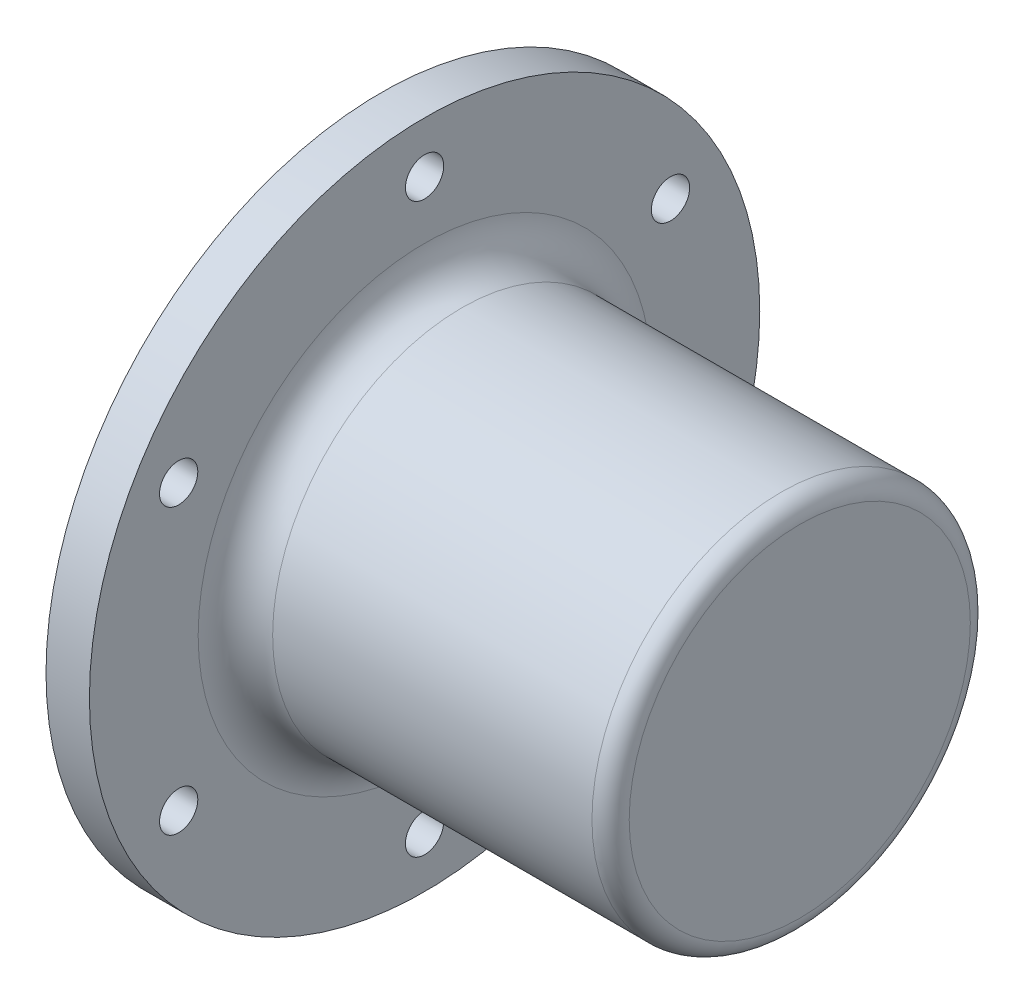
ISO-10303-21;
HEADER;
FILE_DESCRIPTION(('STEP AP214'),'2;1');
FILE_NAME('part.step','',(''),(''),'','','');
FILE_SCHEMA(('AUTOMOTIVE_DESIGN { 1 0 10303 214 1 1 1 1 }'));
ENDSEC;
DATA;
#1=APPLICATION_CONTEXT('core data for automotive mechanical design processes');
#2=APPLICATION_PROTOCOL_DEFINITION('international standard','automotive_design',2000,#1);
#3=PRODUCT_CONTEXT('',#1,'mechanical');
#4=PRODUCT('Part','Part','',(#3));
#5=PRODUCT_RELATED_PRODUCT_CATEGORY('part','',(#4));
#6=PRODUCT_DEFINITION_FORMATION('','',#4);
#7=PRODUCT_DEFINITION_CONTEXT('part definition',#1,'design');
#8=PRODUCT_DEFINITION('design','',#6,#7);
#9=PRODUCT_DEFINITION_SHAPE('','',#8);
#10=(LENGTH_UNIT() NAMED_UNIT(*) SI_UNIT(.MILLI.,.METRE.));
#11=(NAMED_UNIT(*) PLANE_ANGLE_UNIT() SI_UNIT($,.RADIAN.));
#12=(NAMED_UNIT(*) SI_UNIT($,.STERADIAN.) SOLID_ANGLE_UNIT());
#13=UNCERTAINTY_MEASURE_WITH_UNIT(LENGTH_MEASURE(1.E-05),#10,'distance_accuracy_value','');
#14=(GEOMETRIC_REPRESENTATION_CONTEXT(3) GLOBAL_UNCERTAINTY_ASSIGNED_CONTEXT((#13)) GLOBAL_UNIT_ASSIGNED_CONTEXT((#10,
#11,#12)) REPRESENTATION_CONTEXT('',''));
#15=CARTESIAN_POINT('',(0.,0.,0.));
#16=DIRECTION('',(0.,0.,1.));
#17=DIRECTION('',(1.,0.,0.));
#18=AXIS2_PLACEMENT_3D('',#15,#16,#17);
#19=CARTESIAN_POINT('',(26.2549735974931,28.575,0.));
#20=DIRECTION('',(-1.,0.,0.));
#21=DIRECTION('',(0.,0.,1.));
#22=AXIS2_PLACEMENT_3D('',#19,#20,#21);
#23=PLANE('',#22);
#24=CARTESIAN_POINT('',(26.2549735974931,0.,0.));
#25=DIRECTION('',(-1.,0.,0.));
#26=DIRECTION('',(0.,0.,1.));
#27=AXIS2_PLACEMENT_3D('',#24,#25,#26);
#28=CIRCLE('',#27,19.304);
#29=CARTESIAN_POINT('',(26.2549735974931,0.,19.304));
#30=VERTEX_POINT('',#29);
#31=EDGE_CURVE('E63',#30,#30,#28,.T.);
#32=ORIENTED_EDGE('',*,*,#31,.T.);
#33=EDGE_LOOP('',(#32));
#34=FACE_BOUND('',#33,.T.);
#35=CARTESIAN_POINT('',(26.2549735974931,-12.1046874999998,-20.965933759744));
#36=DIRECTION('',(1.,0.,0.));
#37=DIRECTION('',(0.,0.,-1.));
#38=AXIS2_PLACEMENT_3D('',#35,#36,#37);
#39=CIRCLE('',#38,1.63194999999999);
#40=CARTESIAN_POINT('',(26.2549735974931,-12.1046874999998,-22.597883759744));
#41=VERTEX_POINT('',#40);
#42=EDGE_CURVE('E138',#41,#41,#39,.T.);
#43=ORIENTED_EDGE('',*,*,#42,.F.);
#44=EDGE_LOOP('',(#43));
#45=FACE_BOUND('',#44,.T.);
#46=CARTESIAN_POINT('',(26.2549735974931,-24.209375,-1.69053162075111E-13));
#47=DIRECTION('',(1.,0.,0.));
#48=DIRECTION('',(0.,0.,-1.));
#49=AXIS2_PLACEMENT_3D('',#46,#47,#48);
#50=CIRCLE('',#49,1.63194999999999);
#51=CARTESIAN_POINT('',(26.2549735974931,-24.209375,-1.63195000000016));
#52=VERTEX_POINT('',#51);
#53=EDGE_CURVE('E132',#52,#52,#50,.T.);
#54=ORIENTED_EDGE('',*,*,#53,.F.);
#55=EDGE_LOOP('',(#54));
#56=FACE_BOUND('',#55,.T.);
#57=CARTESIAN_POINT('',(26.2549735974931,-12.1046875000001,20.9659337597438));
#58=DIRECTION('',(1.,0.,0.));
#59=DIRECTION('',(0.,0.,-1.));
#60=AXIS2_PLACEMENT_3D('',#57,#58,#59);
#61=CIRCLE('',#60,1.63194999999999);
#62=CARTESIAN_POINT('',(26.2549735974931,-12.1046875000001,19.3339837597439));
#63=VERTEX_POINT('',#62);
#64=EDGE_CURVE('E126',#63,#63,#61,.T.);
#65=ORIENTED_EDGE('',*,*,#64,.F.);
#66=EDGE_LOOP('',(#65));
#67=FACE_BOUND('',#66,.T.);
#68=CARTESIAN_POINT('',(26.2549735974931,12.1046875,20.9659337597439));
#69=DIRECTION('',(1.,0.,0.));
#70=DIRECTION('',(0.,0.,-1.));
#71=AXIS2_PLACEMENT_3D('',#68,#69,#70);
#72=CIRCLE('',#71,1.63194999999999);
#73=CARTESIAN_POINT('',(26.2549735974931,12.1046875,19.3339837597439));
#74=VERTEX_POINT('',#73);
#75=EDGE_CURVE('E120',#74,#74,#72,.T.);
#76=ORIENTED_EDGE('',*,*,#75,.F.);
#77=EDGE_LOOP('',(#76));
#78=FACE_BOUND('',#77,.T.);
#79=CARTESIAN_POINT('',(26.2549735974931,24.209375,0.));
#80=DIRECTION('',(1.,0.,0.));
#81=DIRECTION('',(0.,0.,-1.));
#82=AXIS2_PLACEMENT_3D('',#79,#80,#81);
#83=CIRCLE('',#82,1.63194999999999);
#84=CARTESIAN_POINT('',(26.2549735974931,24.209375,-1.63194999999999));
#85=VERTEX_POINT('',#84);
#86=EDGE_CURVE('E114',#85,#85,#83,.T.);
#87=ORIENTED_EDGE('',*,*,#86,.F.);
#88=EDGE_LOOP('',(#87));
#89=FACE_BOUND('',#88,.T.);
#90=CARTESIAN_POINT('',(26.2549735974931,0.,0.));
#91=DIRECTION('',(-1.,0.,0.));
#92=DIRECTION('',(0.,0.,1.));
#93=AXIS2_PLACEMENT_3D('',#90,#91,#92);
#94=CIRCLE('',#93,28.575);
#95=CARTESIAN_POINT('',(26.2549735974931,0.,28.575));
#96=VERTEX_POINT('',#95);
#97=EDGE_CURVE('E66',#96,#96,#94,.T.);
#98=ORIENTED_EDGE('',*,*,#97,.F.);
#99=EDGE_LOOP('',(#98));
#100=FACE_BOUND('',#99,.T.);
#101=CARTESIAN_POINT('',(26.2549735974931,12.1046875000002,-20.9659337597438));
#102=DIRECTION('',(1.,0.,0.));
#103=DIRECTION('',(0.,0.,-1.));
#104=AXIS2_PLACEMENT_3D('',#101,#102,#103);
#105=CIRCLE('',#104,1.63194999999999);
#106=CARTESIAN_POINT('',(26.2549735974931,12.1046875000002,-22.5978837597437));
#107=VERTEX_POINT('',#106);
#108=EDGE_CURVE('E144',#107,#107,#105,.T.);
#109=ORIENTED_EDGE('',*,*,#108,.F.);
#110=EDGE_LOOP('',(#109));
#111=FACE_BOUND('',#110,.T.);
#112=ADVANCED_FACE('F40',(#34,#45,#56,#67,#78,#89,#100,#111),#23,.F.);
#113=CARTESIAN_POINT('',(22.554115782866,15.24,0.));
#114=DIRECTION('',(1.,0.,0.));
#115=DIRECTION('',(0.,0.,-1.));
#116=AXIS2_PLACEMENT_3D('',#113,#114,#115);
#117=PLANE('',#116);
#118=CARTESIAN_POINT('',(22.554115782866,0.,0.));
#119=DIRECTION('',(1.,0.,0.));
#120=DIRECTION('',(0.,0.,-1.));
#121=AXIS2_PLACEMENT_3D('',#118,#119,#120);
#122=CIRCLE('',#121,18.7991893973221);
#123=CARTESIAN_POINT('',(22.554115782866,0.,-18.7991893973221));
#124=VERTEX_POINT('',#123);
#125=EDGE_CURVE('E96',#124,#124,#122,.T.);
#126=ORIENTED_EDGE('',*,*,#125,.F.);
#127=EDGE_LOOP('',(#126));
#128=FACE_BOUND('',#127,.T.);
#129=CARTESIAN_POINT('',(22.554115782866,0.,0.));
#130=DIRECTION('',(1.,0.,0.));
#131=DIRECTION('',(0.,0.,-1.));
#132=AXIS2_PLACEMENT_3D('',#129,#130,#131);
#133=CIRCLE('',#132,18.1578106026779);
#134=CARTESIAN_POINT('',(22.554115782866,0.,-18.1578106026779));
#135=VERTEX_POINT('',#134);
#136=EDGE_CURVE('E81',#135,#135,#133,.T.);
#137=ORIENTED_EDGE('',*,*,#136,.T.);
#138=EDGE_LOOP('',(#137));
#139=FACE_BOUND('',#138,.T.);
#140=ADVANCED_FACE('F151',(#128,#139),#117,.F.);
#141=CARTESIAN_POINT('',(23.570115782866,0.,0.));
#142=DIRECTION('',(1.,0.,0.));
#143=DIRECTION('',(0.,0.,-1.));
#144=AXIS2_PLACEMENT_3D('',#141,#142,#143);
#145=TOROIDAL_SURFACE('',#144,15.9680481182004,0.254000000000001);
#146=CARTESIAN_POINT('',(23.824115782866,0.,0.));
#147=DIRECTION('',(1.,0.,0.));
#148=DIRECTION('',(0.,0.,-1.));
#149=AXIS2_PLACEMENT_3D('',#146,#147,#148);
#150=CIRCLE('',#149,15.9680481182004);
#151=CARTESIAN_POINT('',(23.824115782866,0.,-15.9680481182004));
#152=VERTEX_POINT('',#151);
#153=EDGE_CURVE('E90',#152,#152,#150,.T.);
#154=ORIENTED_EDGE('',*,*,#153,.F.);
#155=EDGE_LOOP('',(#154));
#156=FACE_BOUND('',#155,.T.);
#157=CARTESIAN_POINT('',(23.5922533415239,0.,0.));
#158=DIRECTION('',(1.,0.,0.));
#159=DIRECTION('',(0.,0.,-1.));
#160=AXIS2_PLACEMENT_3D('',#157,#158,#159);
#161=CIRCLE('',#160,15.7150146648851);
#162=CARTESIAN_POINT('',(23.5922533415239,0.,-15.7150146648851));
#163=VERTEX_POINT('',#162);
#164=EDGE_CURVE('E75',#163,#163,#161,.T.);
#165=ORIENTED_EDGE('',*,*,#164,.T.);
#166=EDGE_LOOP('',(#165));
#167=FACE_BOUND('',#166,.T.);
#168=ADVANCED_FACE('F157',(#156,#167),#145,.F.);
#169=CARTESIAN_POINT('',(22.554115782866,0.,0.));
#170=DIRECTION('',(1.,0.,0.));
#171=DIRECTION('',(0.,0.,-1.));
#172=AXIS2_PLACEMENT_3D('',#169,#170,#171);
#173=CONICAL_SURFACE('',#172,15.6241893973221,0.0872664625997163);
#174=ORIENTED_EDGE('',*,*,#164,.F.);
#175=EDGE_LOOP('',(#174));
#176=FACE_BOUND('',#175,.T.);
#177=CARTESIAN_POINT('',(22.554115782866,0.,0.));
#178=DIRECTION('',(1.,0.,0.));
#179=DIRECTION('',(0.,0.,-1.));
#180=AXIS2_PLACEMENT_3D('',#177,#178,#179);
#181=CIRCLE('',#180,15.6241893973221);
#182=CARTESIAN_POINT('',(22.554115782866,0.,-15.6241893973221));
#183=VERTEX_POINT('',#182);
#184=EDGE_CURVE('E78',#183,#183,#181,.T.);
#185=ORIENTED_EDGE('',*,*,#184,.T.);
#186=EDGE_LOOP('',(#185));
#187=FACE_BOUND('',#186,.T.);
#188=ADVANCED_FACE('F238',(#176,#187),#173,.T.);
#189=CARTESIAN_POINT('',(23.5922533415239,0.,0.));
#190=DIRECTION('',(-1.,0.,0.));
#191=DIRECTION('',(0.,0.,1.));
#192=AXIS2_PLACEMENT_3D('',#189,#190,#191);
#193=CONICAL_SURFACE('',#192,18.0669853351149,0.0872664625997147);
#194=ORIENTED_EDGE('',*,*,#136,.F.);
#195=EDGE_LOOP('',(#194));
#196=FACE_BOUND('',#195,.T.);
#197=CARTESIAN_POINT('',(23.5922533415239,0.,0.));
#198=DIRECTION('',(1.,0.,0.));
#199=DIRECTION('',(0.,0.,-1.));
#200=AXIS2_PLACEMENT_3D('',#197,#198,#199);
#201=CIRCLE('',#200,18.0669853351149);
#202=CARTESIAN_POINT('',(23.5922533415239,0.,-18.0669853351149));
#203=VERTEX_POINT('',#202);
#204=EDGE_CURVE('E84',#203,#203,#201,.T.);
#205=ORIENTED_EDGE('',*,*,#204,.T.);
#206=EDGE_LOOP('',(#205));
#207=FACE_BOUND('',#206,.T.);
#208=ADVANCED_FACE('F234',(#196,#207),#193,.F.);
#209=CARTESIAN_POINT('',(23.570115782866,0.,0.));
#210=DIRECTION('',(1.,0.,0.));
#211=DIRECTION('',(0.,0.,-1.));
#212=AXIS2_PLACEMENT_3D('',#209,#210,#211);
#213=TOROIDAL_SURFACE('',#212,17.8139518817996,0.254);
#214=ORIENTED_EDGE('',*,*,#204,.F.);
#215=EDGE_LOOP('',(#214));
#216=FACE_BOUND('',#215,.T.);
#217=CARTESIAN_POINT('',(23.824115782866,0.,0.));
#218=DIRECTION('',(1.,0.,0.));
#219=DIRECTION('',(0.,0.,-1.));
#220=AXIS2_PLACEMENT_3D('',#217,#218,#219);
#221=CIRCLE('',#220,17.8139518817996);
#222=CARTESIAN_POINT('',(23.824115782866,0.,-17.8139518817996));
#223=VERTEX_POINT('',#222);
#224=EDGE_CURVE('E87',#223,#223,#221,.T.);
#225=ORIENTED_EDGE('',*,*,#224,.T.);
#226=EDGE_LOOP('',(#225));
#227=FACE_BOUND('',#226,.T.);
#228=ADVANCED_FACE('F196',(#216,#227),#213,.F.);
#229=CARTESIAN_POINT('',(23.824115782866,17.8139518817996,0.));
#230=DIRECTION('',(1.,0.,0.));
#231=DIRECTION('',(0.,0.,-1.));
#232=AXIS2_PLACEMENT_3D('',#229,#230,#231);
#233=PLANE('',#232);
#234=ORIENTED_EDGE('',*,*,#224,.F.);
#235=EDGE_LOOP('',(#234));
#236=FACE_BOUND('',#235,.T.);
#237=ORIENTED_EDGE('',*,*,#153,.T.);
#238=EDGE_LOOP('',(#237));
#239=FACE_BOUND('',#238,.T.);
#240=ADVANCED_FACE('F188',(#236,#239),#233,.F.);
#241=CARTESIAN_POINT('',(55.447115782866,0.,0.));
#242=DIRECTION('',(1.,0.,0.));
#243=DIRECTION('',(0.,0.,-1.));
#244=AXIS2_PLACEMENT_3D('',#241,#242,#243);
#245=PLANE('',#244);
#246=CARTESIAN_POINT('',(55.447115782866,0.,0.));
#247=DIRECTION('',(1.,0.,0.));
#248=DIRECTION('',(0.,0.,-1.));
#249=AXIS2_PLACEMENT_3D('',#246,#247,#248);
#250=CIRCLE('',#249,13.6525);
#251=CARTESIAN_POINT('',(55.447115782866,0.,-13.6525));
#252=VERTEX_POINT('',#251);
#253=EDGE_CURVE('E55',#252,#252,#250,.F.);
#254=ORIENTED_EDGE('',*,*,#253,.T.);
#255=EDGE_LOOP('',(#254));
#256=FACE_BOUND('',#255,.T.);
#257=ADVANCED_FACE('F185',(#256),#245,.F.);
#258=CARTESIAN_POINT('',(0.,0.,0.));
#259=DIRECTION('',(-1.,0.,0.));
#260=DIRECTION('',(0.,0.,1.));
#261=AXIS2_PLACEMENT_3D('',#258,#259,#260);
#262=CYLINDRICAL_SURFACE('',#261,15.24);
#263=CARTESIAN_POINT('',(53.859615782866,0.,0.));
#264=DIRECTION('',(1.,0.,0.));
#265=DIRECTION('',(0.,0.,-1.));
#266=AXIS2_PLACEMENT_3D('',#263,#264,#265);
#267=CIRCLE('',#266,15.24);
#268=CARTESIAN_POINT('',(53.859615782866,0.,-15.24));
#269=VERTEX_POINT('',#268);
#270=EDGE_CURVE('E51',#269,#269,#267,.T.);
#271=ORIENTED_EDGE('',*,*,#270,.T.);
#272=EDGE_LOOP('',(#271));
#273=FACE_BOUND('',#272,.T.);
#274=CARTESIAN_POINT('',(22.554115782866,0.,0.));
#275=DIRECTION('',(-1.,0.,0.));
#276=DIRECTION('',(0.,0.,1.));
#277=AXIS2_PLACEMENT_3D('',#274,#275,#276);
#278=CIRCLE('',#277,15.24);
#279=CARTESIAN_POINT('',(22.554115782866,0.,15.24));
#280=VERTEX_POINT('',#279);
#281=EDGE_CURVE('E69',#280,#280,#278,.T.);
#282=ORIENTED_EDGE('',*,*,#281,.T.);
#283=EDGE_LOOP('',(#282));
#284=FACE_BOUND('',#283,.T.);
#285=ADVANCED_FACE('F187',(#273,#284),#262,.F.);
#286=ORIENTED_EDGE('',*,*,#184,.F.);
#287=EDGE_LOOP('',(#286));
#288=FACE_BOUND('',#287,.T.);
#289=ORIENTED_EDGE('',*,*,#281,.F.);
#290=EDGE_LOOP('',(#289));
#291=FACE_BOUND('',#290,.T.);
#292=ADVANCED_FACE('F160',(#288,#291),#117,.F.);
#293=CARTESIAN_POINT('',(23.570115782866,0.,0.));
#294=DIRECTION('',(1.,0.,0.));
#295=DIRECTION('',(0.,0.,-1.));
#296=AXIS2_PLACEMENT_3D('',#293,#294,#295);
#297=TOROIDAL_SURFACE('',#296,19.1430481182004,0.254000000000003);
#298=CARTESIAN_POINT('',(23.824115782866,0.,0.));
#299=DIRECTION('',(1.,0.,0.));
#300=DIRECTION('',(0.,0.,-1.));
#301=AXIS2_PLACEMENT_3D('',#298,#299,#300);
#302=CIRCLE('',#301,19.1430481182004);
#303=CARTESIAN_POINT('',(23.824115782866,0.,-19.1430481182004));
#304=VERTEX_POINT('',#303);
#305=EDGE_CURVE('E108',#304,#304,#302,.T.);
#306=ORIENTED_EDGE('',*,*,#305,.F.);
#307=EDGE_LOOP('',(#306));
#308=FACE_BOUND('',#307,.T.);
#309=CARTESIAN_POINT('',(23.5922533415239,0.,0.));
#310=DIRECTION('',(1.,0.,0.));
#311=DIRECTION('',(0.,0.,-1.));
#312=AXIS2_PLACEMENT_3D('',#309,#310,#311);
#313=CIRCLE('',#312,18.8900146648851);
#314=CARTESIAN_POINT('',(23.5922533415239,0.,-18.8900146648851));
#315=VERTEX_POINT('',#314);
#316=EDGE_CURVE('E93',#315,#315,#313,.T.);
#317=ORIENTED_EDGE('',*,*,#316,.T.);
#318=EDGE_LOOP('',(#317));
#319=FACE_BOUND('',#318,.T.);
#320=ADVANCED_FACE('F227',(#308,#319),#297,.F.);
#321=CARTESIAN_POINT('',(22.554115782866,0.,0.));
#322=DIRECTION('',(1.,0.,0.));
#323=DIRECTION('',(0.,0.,-1.));
#324=AXIS2_PLACEMENT_3D('',#321,#322,#323);
#325=CONICAL_SURFACE('',#324,18.7991893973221,0.0872664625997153);
#326=ORIENTED_EDGE('',*,*,#316,.F.);
#327=EDGE_LOOP('',(#326));
#328=FACE_BOUND('',#327,.T.);
#329=ORIENTED_EDGE('',*,*,#125,.T.);
#330=EDGE_LOOP('',(#329));
#331=FACE_BOUND('',#330,.T.);
#332=ADVANCED_FACE('F223',(#328,#331),#325,.T.);
#333=CARTESIAN_POINT('',(23.5922533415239,0.,0.));
#334=DIRECTION('',(-1.,0.,0.));
#335=DIRECTION('',(0.,0.,1.));
#336=AXIS2_PLACEMENT_3D('',#333,#334,#335);
#337=CONICAL_SURFACE('',#336,21.4959853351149,0.0872664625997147);
#338=CARTESIAN_POINT('',(22.554115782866,0.,0.));
#339=DIRECTION('',(1.,0.,0.));
#340=DIRECTION('',(0.,0.,-1.));
#341=AXIS2_PLACEMENT_3D('',#338,#339,#340);
#342=CIRCLE('',#341,21.5868106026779);
#343=CARTESIAN_POINT('',(22.554115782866,0.,-21.5868106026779));
#344=VERTEX_POINT('',#343);
#345=EDGE_CURVE('E99',#344,#344,#342,.T.);
#346=ORIENTED_EDGE('',*,*,#345,.F.);
#347=EDGE_LOOP('',(#346));
#348=FACE_BOUND('',#347,.T.);
#349=CARTESIAN_POINT('',(23.5922533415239,0.,0.));
#350=DIRECTION('',(1.,0.,0.));
#351=DIRECTION('',(0.,0.,-1.));
#352=AXIS2_PLACEMENT_3D('',#349,#350,#351);
#353=CIRCLE('',#352,21.4959853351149);
#354=CARTESIAN_POINT('',(23.5922533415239,0.,-21.4959853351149));
#355=VERTEX_POINT('',#354);
#356=EDGE_CURVE('E102',#355,#355,#353,.T.);
#357=ORIENTED_EDGE('',*,*,#356,.T.);
#358=EDGE_LOOP('',(#357));
#359=FACE_BOUND('',#358,.T.);
#360=ADVANCED_FACE('F212',(#348,#359),#337,.F.);
#361=CARTESIAN_POINT('',(23.570115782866,0.,0.));
#362=DIRECTION('',(1.,0.,0.));
#363=DIRECTION('',(0.,0.,-1.));
#364=AXIS2_PLACEMENT_3D('',#361,#362,#363);
#365=TOROIDAL_SURFACE('',#364,21.2429518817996,0.253999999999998);
#366=ORIENTED_EDGE('',*,*,#356,.F.);
#367=EDGE_LOOP('',(#366));
#368=FACE_BOUND('',#367,.T.);
#369=CARTESIAN_POINT('',(23.824115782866,0.,0.));
#370=DIRECTION('',(1.,0.,0.));
#371=DIRECTION('',(0.,0.,-1.));
#372=AXIS2_PLACEMENT_3D('',#369,#370,#371);
#373=CIRCLE('',#372,21.2429518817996);
#374=CARTESIAN_POINT('',(23.824115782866,0.,-21.2429518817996));
#375=VERTEX_POINT('',#374);
#376=EDGE_CURVE('E105',#375,#375,#373,.T.);
#377=ORIENTED_EDGE('',*,*,#376,.T.);
#378=EDGE_LOOP('',(#377));
#379=FACE_BOUND('',#378,.T.);
#380=ADVANCED_FACE('F206',(#368,#379),#365,.F.);
#381=CARTESIAN_POINT('',(23.824115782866,21.2429518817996,0.));
#382=DIRECTION('',(1.,0.,0.));
#383=DIRECTION('',(0.,0.,-1.));
#384=AXIS2_PLACEMENT_3D('',#381,#382,#383);
#385=PLANE('',#384);
#386=ORIENTED_EDGE('',*,*,#376,.F.);
#387=EDGE_LOOP('',(#386));
#388=FACE_BOUND('',#387,.T.);
#389=ORIENTED_EDGE('',*,*,#305,.T.);
#390=EDGE_LOOP('',(#389));
#391=FACE_BOUND('',#390,.T.);
#392=ADVANCED_FACE('F201',(#388,#391),#385,.F.);
#393=CARTESIAN_POINT('',(58.241115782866,16.129,0.));
#394=DIRECTION('',(-1.,0.,0.));
#395=DIRECTION('',(0.,0.,1.));
#396=AXIS2_PLACEMENT_3D('',#393,#394,#395);
#397=PLANE('',#396);
#398=CARTESIAN_POINT('',(58.241115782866,0.,0.));
#399=DIRECTION('',(-1.,0.,0.));
#400=DIRECTION('',(0.,0.,1.));
#401=AXIS2_PLACEMENT_3D('',#398,#399,#400);
#402=CIRCLE('',#401,14.5415);
#403=CARTESIAN_POINT('',(58.241115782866,0.,14.5415));
#404=VERTEX_POINT('',#403);
#405=EDGE_CURVE('E10',#404,#404,#402,.F.);
#406=ORIENTED_EDGE('',*,*,#405,.T.);
#407=EDGE_LOOP('',(#406));
#408=FACE_BOUND('',#407,.T.);
#409=ADVANCED_FACE('F199',(#408),#397,.F.);
#410=CARTESIAN_POINT('',(0.,0.,0.));
#411=DIRECTION('',(-1.,0.,0.));
#412=DIRECTION('',(0.,0.,1.));
#413=AXIS2_PLACEMENT_3D('',#410,#411,#412);
#414=CYLINDRICAL_SURFACE('',#413,16.129);
#415=CARTESIAN_POINT('',(56.653615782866,0.,0.));
#416=DIRECTION('',(-1.,0.,0.));
#417=DIRECTION('',(0.,0.,1.));
#418=AXIS2_PLACEMENT_3D('',#415,#416,#417);
#419=CIRCLE('',#418,16.129);
#420=CARTESIAN_POINT('',(56.653615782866,0.,16.129));
#421=VERTEX_POINT('',#420);
#422=EDGE_CURVE('E47',#421,#421,#419,.T.);
#423=ORIENTED_EDGE('',*,*,#422,.T.);
#424=EDGE_LOOP('',(#423));
#425=FACE_BOUND('',#424,.T.);
#426=CARTESIAN_POINT('',(29.4299735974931,0.,0.));
#427=DIRECTION('',(-1.,0.,0.));
#428=DIRECTION('',(0.,0.,1.));
#429=AXIS2_PLACEMENT_3D('',#426,#427,#428);
#430=CIRCLE('',#429,16.129);
#431=CARTESIAN_POINT('',(29.4299735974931,0.,16.129));
#432=VERTEX_POINT('',#431);
#433=EDGE_CURVE('E60',#432,#432,#430,.F.);
#434=ORIENTED_EDGE('',*,*,#433,.T.);
#435=EDGE_LOOP('',(#434));
#436=FACE_BOUND('',#435,.T.);
#437=ADVANCED_FACE('F165',(#425,#436),#414,.T.);
#438=CARTESIAN_POINT('',(0.,0.,0.));
#439=DIRECTION('',(-1.,0.,0.));
#440=DIRECTION('',(0.,0.,1.));
#441=AXIS2_PLACEMENT_3D('',#438,#439,#440);
#442=CYLINDRICAL_SURFACE('',#441,28.575);
#443=CARTESIAN_POINT('',(22.554115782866,0.,0.));
#444=DIRECTION('',(-1.,0.,0.));
#445=DIRECTION('',(0.,0.,1.));
#446=AXIS2_PLACEMENT_3D('',#443,#444,#445);
#447=CIRCLE('',#446,28.575);
#448=CARTESIAN_POINT('',(22.554115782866,0.,28.575));
#449=VERTEX_POINT('',#448);
#450=EDGE_CURVE('E72',#449,#449,#447,.T.);
#451=ORIENTED_EDGE('',*,*,#450,.F.);
#452=EDGE_LOOP('',(#451));
#453=FACE_BOUND('',#452,.T.);
#454=ORIENTED_EDGE('',*,*,#97,.T.);
#455=EDGE_LOOP('',(#454));
#456=FACE_BOUND('',#455,.T.);
#457=ADVANCED_FACE('F167',(#453,#456),#442,.T.);
#458=CARTESIAN_POINT('',(22.554115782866,12.1046875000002,-20.9659337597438));
#459=DIRECTION('',(1.,0.,0.));
#460=DIRECTION('',(0.,0.,-1.));
#461=AXIS2_PLACEMENT_3D('',#458,#459,#460);
#462=CIRCLE('',#461,1.63195);
#463=CARTESIAN_POINT('',(22.554115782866,12.1046875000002,-22.5978837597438));
#464=VERTEX_POINT('',#463);
#465=EDGE_CURVE('E141',#464,#464,#462,.T.);
#466=ORIENTED_EDGE('',*,*,#465,.T.);
#467=EDGE_LOOP('',(#466));
#468=FACE_BOUND('',#467,.T.);
#469=CARTESIAN_POINT('',(22.554115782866,-12.1046874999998,-20.965933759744));
#470=DIRECTION('',(1.,0.,0.));
#471=DIRECTION('',(0.,0.,-1.));
#472=AXIS2_PLACEMENT_3D('',#469,#470,#471);
#473=CIRCLE('',#472,1.63195);
#474=CARTESIAN_POINT('',(22.554115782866,-12.1046874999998,-22.597883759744));
#475=VERTEX_POINT('',#474);
#476=EDGE_CURVE('E135',#475,#475,#473,.T.);
#477=ORIENTED_EDGE('',*,*,#476,.T.);
#478=EDGE_LOOP('',(#477));
#479=FACE_BOUND('',#478,.T.);
#480=CARTESIAN_POINT('',(22.554115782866,-24.209375,-1.69053162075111E-13));
#481=DIRECTION('',(1.,0.,0.));
#482=DIRECTION('',(0.,0.,-1.));
#483=AXIS2_PLACEMENT_3D('',#480,#481,#482);
#484=CIRCLE('',#483,1.63195);
#485=CARTESIAN_POINT('',(22.554115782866,-24.209375,-1.63195000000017));
#486=VERTEX_POINT('',#485);
#487=EDGE_CURVE('E129',#486,#486,#484,.T.);
#488=ORIENTED_EDGE('',*,*,#487,.T.);
#489=EDGE_LOOP('',(#488));
#490=FACE_BOUND('',#489,.T.);
#491=CARTESIAN_POINT('',(22.554115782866,-12.1046875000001,20.9659337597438));
#492=DIRECTION('',(1.,0.,0.));
#493=DIRECTION('',(0.,0.,-1.));
#494=AXIS2_PLACEMENT_3D('',#491,#492,#493);
#495=CIRCLE('',#494,1.63195);
#496=CARTESIAN_POINT('',(22.554115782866,-12.1046875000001,19.3339837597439));
#497=VERTEX_POINT('',#496);
#498=EDGE_CURVE('E123',#497,#497,#495,.T.);
#499=ORIENTED_EDGE('',*,*,#498,.T.);
#500=EDGE_LOOP('',(#499));
#501=FACE_BOUND('',#500,.T.);
#502=CARTESIAN_POINT('',(22.554115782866,12.1046875,20.9659337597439));
#503=DIRECTION('',(1.,0.,0.));
#504=DIRECTION('',(0.,0.,-1.));
#505=AXIS2_PLACEMENT_3D('',#502,#503,#504);
#506=CIRCLE('',#505,1.63195);
#507=CARTESIAN_POINT('',(22.554115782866,12.1046875,19.3339837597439));
#508=VERTEX_POINT('',#507);
#509=EDGE_CURVE('E117',#508,#508,#506,.T.);
#510=ORIENTED_EDGE('',*,*,#509,.T.);
#511=EDGE_LOOP('',(#510));
#512=FACE_BOUND('',#511,.T.);
#513=CARTESIAN_POINT('',(22.554115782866,24.209375,0.));
#514=DIRECTION('',(1.,0.,0.));
#515=DIRECTION('',(0.,0.,-1.));
#516=AXIS2_PLACEMENT_3D('',#513,#514,#515);
#517=CIRCLE('',#516,1.63195);
#518=CARTESIAN_POINT('',(22.554115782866,24.209375,-1.63195));
#519=VERTEX_POINT('',#518);
#520=EDGE_CURVE('E111',#519,#519,#517,.T.);
#521=ORIENTED_EDGE('',*,*,#520,.T.);
#522=EDGE_LOOP('',(#521));
#523=FACE_BOUND('',#522,.T.);
#524=ORIENTED_EDGE('',*,*,#345,.T.);
#525=EDGE_LOOP('',(#524));
#526=FACE_BOUND('',#525,.T.);
#527=ORIENTED_EDGE('',*,*,#450,.T.);
#528=EDGE_LOOP('',(#527));
#529=FACE_BOUND('',#528,.T.);
#530=ADVANCED_FACE('F161',(#468,#479,#490,#501,#512,#523,#526,#529),#117,.F.);
#531=CARTESIAN_POINT('',(26.2549735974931,24.209375,0.));
#532=DIRECTION('',(1.,0.,0.));
#533=DIRECTION('',(0.,0.,-1.));
#534=AXIS2_PLACEMENT_3D('',#531,#532,#533);
#535=CYLINDRICAL_SURFACE('',#534,1.63194999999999);
#536=ORIENTED_EDGE('',*,*,#520,.F.);
#537=EDGE_LOOP('',(#536));
#538=FACE_BOUND('',#537,.T.);
#539=ORIENTED_EDGE('',*,*,#86,.T.);
#540=EDGE_LOOP('',(#539));
#541=FACE_BOUND('',#540,.T.);
#542=ADVANCED_FACE('F218',(#538,#541),#535,.F.);
#543=CARTESIAN_POINT('',(26.2549735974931,12.1046875,20.9659337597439));
#544=DIRECTION('',(1.,0.,0.));
#545=DIRECTION('',(0.,0.,-1.));
#546=AXIS2_PLACEMENT_3D('',#543,#544,#545);
#547=CYLINDRICAL_SURFACE('',#546,1.63194999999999);
#548=ORIENTED_EDGE('',*,*,#509,.F.);
#549=EDGE_LOOP('',(#548));
#550=FACE_BOUND('',#549,.T.);
#551=ORIENTED_EDGE('',*,*,#75,.T.);
#552=EDGE_LOOP('',(#551));
#553=FACE_BOUND('',#552,.T.);
#554=ADVANCED_FACE('F250',(#550,#553),#547,.F.);
#555=CARTESIAN_POINT('',(26.2549735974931,-12.1046875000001,20.9659337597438));
#556=DIRECTION('',(1.,0.,0.));
#557=DIRECTION('',(0.,0.,-1.));
#558=AXIS2_PLACEMENT_3D('',#555,#556,#557);
#559=CYLINDRICAL_SURFACE('',#558,1.63194999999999);
#560=ORIENTED_EDGE('',*,*,#498,.F.);
#561=EDGE_LOOP('',(#560));
#562=FACE_BOUND('',#561,.T.);
#563=ORIENTED_EDGE('',*,*,#64,.T.);
#564=EDGE_LOOP('',(#563));
#565=FACE_BOUND('',#564,.T.);
#566=ADVANCED_FACE('F312',(#562,#565),#559,.F.);
#567=CARTESIAN_POINT('',(26.2549735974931,-24.209375,-1.69053162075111E-13));
#568=DIRECTION('',(1.,0.,0.));
#569=DIRECTION('',(0.,0.,-1.));
#570=AXIS2_PLACEMENT_3D('',#567,#568,#569);
#571=CYLINDRICAL_SURFACE('',#570,1.63194999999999);
#572=ORIENTED_EDGE('',*,*,#487,.F.);
#573=EDGE_LOOP('',(#572));
#574=FACE_BOUND('',#573,.T.);
#575=ORIENTED_EDGE('',*,*,#53,.T.);
#576=EDGE_LOOP('',(#575));
#577=FACE_BOUND('',#576,.T.);
#578=ADVANCED_FACE('F322',(#574,#577),#571,.F.);
#579=CARTESIAN_POINT('',(26.2549735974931,-12.1046874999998,-20.965933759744));
#580=DIRECTION('',(1.,0.,0.));
#581=DIRECTION('',(0.,0.,-1.));
#582=AXIS2_PLACEMENT_3D('',#579,#580,#581);
#583=CYLINDRICAL_SURFACE('',#582,1.63194999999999);
#584=ORIENTED_EDGE('',*,*,#476,.F.);
#585=EDGE_LOOP('',(#584));
#586=FACE_BOUND('',#585,.T.);
#587=ORIENTED_EDGE('',*,*,#42,.T.);
#588=EDGE_LOOP('',(#587));
#589=FACE_BOUND('',#588,.T.);
#590=ADVANCED_FACE('F333',(#586,#589),#583,.F.);
#591=CARTESIAN_POINT('',(26.2549735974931,12.1046875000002,-20.9659337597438));
#592=DIRECTION('',(1.,0.,0.));
#593=DIRECTION('',(0.,0.,-1.));
#594=AXIS2_PLACEMENT_3D('',#591,#592,#593);
#595=CYLINDRICAL_SURFACE('',#594,1.63194999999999);
#596=ORIENTED_EDGE('',*,*,#465,.F.);
#597=EDGE_LOOP('',(#596));
#598=FACE_BOUND('',#597,.T.);
#599=ORIENTED_EDGE('',*,*,#108,.T.);
#600=EDGE_LOOP('',(#599));
#601=FACE_BOUND('',#600,.T.);
#602=ADVANCED_FACE('F148',(#598,#601),#595,.F.);
#603=CARTESIAN_POINT('',(29.4299735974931,0.,0.));
#604=DIRECTION('',(-1.,0.,0.));
#605=DIRECTION('',(0.,0.,1.));
#606=AXIS2_PLACEMENT_3D('',#603,#604,#605);
#607=TOROIDAL_SURFACE('',#606,19.304,3.175);
#608=ORIENTED_EDGE('',*,*,#433,.F.);
#609=EDGE_LOOP('',(#608));
#610=FACE_BOUND('',#609,.T.);
#611=ORIENTED_EDGE('',*,*,#31,.F.);
#612=EDGE_LOOP('',(#611));
#613=FACE_BOUND('',#612,.T.);
#614=ADVANCED_FACE('F171',(#610,#613),#607,.F.);
#615=CARTESIAN_POINT('',(53.859615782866,0.,0.));
#616=DIRECTION('',(1.,0.,0.));
#617=DIRECTION('',(0.,0.,-1.));
#618=AXIS2_PLACEMENT_3D('',#615,#616,#617);
#619=TOROIDAL_SURFACE('',#618,13.6525,1.5875);
#620=ORIENTED_EDGE('',*,*,#270,.F.);
#621=EDGE_LOOP('',(#620));
#622=FACE_BOUND('',#621,.T.);
#623=ORIENTED_EDGE('',*,*,#253,.F.);
#624=EDGE_LOOP('',(#623));
#625=FACE_BOUND('',#624,.T.);
#626=ADVANCED_FACE('F173',(#622,#625),#619,.F.);
#627=CARTESIAN_POINT('',(56.653615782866,0.,0.));
#628=DIRECTION('',(-1.,0.,0.));
#629=DIRECTION('',(0.,0.,1.));
#630=AXIS2_PLACEMENT_3D('',#627,#628,#629);
#631=TOROIDAL_SURFACE('',#630,14.5415,1.5875);
#632=ORIENTED_EDGE('',*,*,#405,.F.);
#633=EDGE_LOOP('',(#632));
#634=FACE_BOUND('',#633,.T.);
#635=ORIENTED_EDGE('',*,*,#422,.F.);
#636=EDGE_LOOP('',(#635));
#637=FACE_BOUND('',#636,.T.);
#638=ADVANCED_FACE('F42',(#634,#637),#631,.T.);
#639=CLOSED_SHELL('',(#112,#140,#168,#188,#208,#228,#240,#257,#285,#292,#320,#332,#360,#380,
#392,#409,#437,#457,#530,#542,#554,#566,#578,#590,#602,#614,#626,#638));
#640=MANIFOLD_SOLID_BREP('B2',#639);
#641=ADVANCED_BREP_SHAPE_REPRESENTATION('',(#18,#640),#14);
#642=SHAPE_DEFINITION_REPRESENTATION(#9,#641);
ENDSEC;
END-ISO-10303-21;
